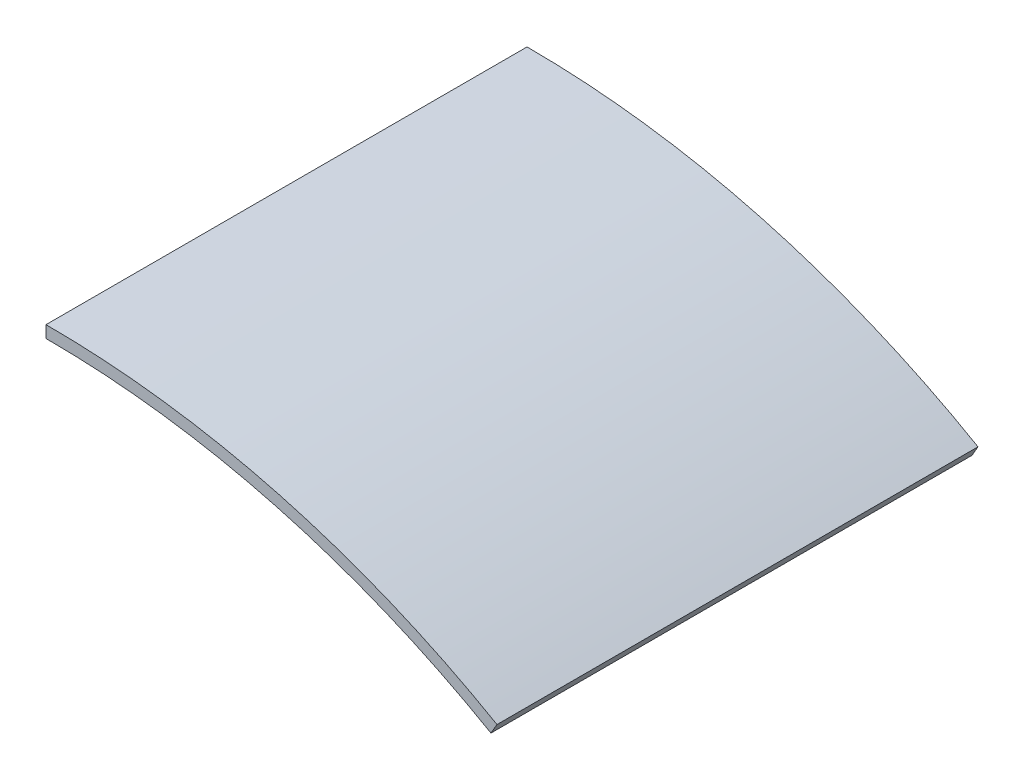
ISO-10303-21;
HEADER;
FILE_DESCRIPTION(('STEP AP214'),'2;1');
FILE_NAME('part.step','',(''),(''),'','','');
FILE_SCHEMA(('AUTOMOTIVE_DESIGN { 1 0 10303 214 1 1 1 1 }'));
ENDSEC;
DATA;
#1=APPLICATION_CONTEXT('core data for automotive mechanical design processes');
#2=APPLICATION_PROTOCOL_DEFINITION('international standard','automotive_design',2000,#1);
#3=PRODUCT_CONTEXT('',#1,'mechanical');
#4=PRODUCT('Part','Part','',(#3));
#5=PRODUCT_RELATED_PRODUCT_CATEGORY('part','',(#4));
#6=PRODUCT_DEFINITION_FORMATION('','',#4);
#7=PRODUCT_DEFINITION_CONTEXT('part definition',#1,'design');
#8=PRODUCT_DEFINITION('design','',#6,#7);
#9=PRODUCT_DEFINITION_SHAPE('','',#8);
#10=(LENGTH_UNIT() NAMED_UNIT(*) SI_UNIT(.MILLI.,.METRE.));
#11=(NAMED_UNIT(*) PLANE_ANGLE_UNIT() SI_UNIT($,.RADIAN.));
#12=(NAMED_UNIT(*) SI_UNIT($,.STERADIAN.) SOLID_ANGLE_UNIT());
#13=UNCERTAINTY_MEASURE_WITH_UNIT(LENGTH_MEASURE(1.E-05),#10,'distance_accuracy_value','');
#14=(GEOMETRIC_REPRESENTATION_CONTEXT(3) GLOBAL_UNCERTAINTY_ASSIGNED_CONTEXT((#13)) GLOBAL_UNIT_ASSIGNED_CONTEXT((#10,
#11,#12)) REPRESENTATION_CONTEXT('',''));
#15=CARTESIAN_POINT('',(0.,0.,0.));
#16=DIRECTION('',(0.,0.,1.));
#17=DIRECTION('',(1.,0.,0.));
#18=AXIS2_PLACEMENT_3D('',#15,#16,#17);
#19=CARTESIAN_POINT('',(0.,0.,20.));
#20=DIRECTION('',(0.,0.,-1.));
#21=DIRECTION('',(-1.,0.,0.));
#22=AXIS2_PLACEMENT_3D('',#19,#20,#21);
#23=CYLINDRICAL_SURFACE('',#22,37.5);
#24=CARTESIAN_POINT('',(0.,0.,0.));
#25=DIRECTION('',(0.,0.,1.));
#26=DIRECTION('',(1.,0.,0.));
#27=AXIS2_PLACEMENT_3D('',#24,#25,#26);
#28=CIRCLE('',#27,37.5);
#29=CARTESIAN_POINT('',(18.75,32.4759526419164,0.));
#30=VERTEX_POINT('',#29);
#31=CARTESIAN_POINT('',(0.,37.5,0.));
#32=VERTEX_POINT('',#31);
#33=EDGE_CURVE('E96',#30,#32,#28,.T.);
#34=ORIENTED_EDGE('',*,*,#33,.T.);
#35=DIRECTION('',(0.,0.,-1.));
#36=VECTOR('',#35,1.);
#37=CARTESIAN_POINT('',(0.,37.5,20.));
#38=LINE('',#37,#36);
#39=CARTESIAN_POINT('',(0.,37.5,20.));
#40=VERTEX_POINT('',#39);
#41=EDGE_CURVE('E11',#40,#32,#38,.T.);
#42=ORIENTED_EDGE('',*,*,#41,.F.);
#43=CARTESIAN_POINT('',(0.,0.,20.));
#44=DIRECTION('',(0.,0.,1.));
#45=DIRECTION('',(1.,0.,0.));
#46=AXIS2_PLACEMENT_3D('',#43,#44,#45);
#47=CIRCLE('',#46,37.5);
#48=CARTESIAN_POINT('',(18.75,32.4759526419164,20.));
#49=VERTEX_POINT('',#48);
#50=EDGE_CURVE('E73',#49,#40,#47,.T.);
#51=ORIENTED_EDGE('',*,*,#50,.F.);
#52=DIRECTION('',(0.,0.,-1.));
#53=VECTOR('',#52,1.);
#54=CARTESIAN_POINT('',(18.75,32.4759526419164,20.));
#55=LINE('',#54,#53);
#56=EDGE_CURVE('E49',#49,#30,#55,.T.);
#57=ORIENTED_EDGE('',*,*,#56,.T.);
#58=EDGE_LOOP('',(#34,#42,#51,#57));
#59=FACE_BOUND('',#58,.T.);
#60=ADVANCED_FACE('F33',(#59),#23,.T.);
#61=CARTESIAN_POINT('',(0.,37.,20.));
#62=DIRECTION('',(-1.,0.,0.));
#63=DIRECTION('',(0.,-1.,0.));
#64=AXIS2_PLACEMENT_3D('',#61,#62,#63);
#65=PLANE('',#64);
#66=DIRECTION('',(0.,1.,0.));
#67=VECTOR('',#66,1.);
#68=CARTESIAN_POINT('',(0.,37.,0.));
#69=LINE('',#68,#67);
#70=CARTESIAN_POINT('',(0.,37.,0.));
#71=VERTEX_POINT('',#70);
#72=EDGE_CURVE('E82',#71,#32,#69,.T.);
#73=ORIENTED_EDGE('',*,*,#72,.F.);
#74=DIRECTION('',(0.,0.,-1.));
#75=VECTOR('',#74,1.);
#76=CARTESIAN_POINT('',(0.,37.,20.));
#77=LINE('',#76,#75);
#78=CARTESIAN_POINT('',(0.,37.,20.));
#79=VERTEX_POINT('',#78);
#80=EDGE_CURVE('E41',#79,#71,#77,.T.);
#81=ORIENTED_EDGE('',*,*,#80,.F.);
#82=DIRECTION('',(0.,1.,0.));
#83=VECTOR('',#82,1.);
#84=CARTESIAN_POINT('',(0.,37.,20.));
#85=LINE('',#84,#83);
#86=EDGE_CURVE('E80',#79,#40,#85,.T.);
#87=ORIENTED_EDGE('',*,*,#86,.T.);
#88=ORIENTED_EDGE('',*,*,#41,.T.);
#89=EDGE_LOOP('',(#73,#81,#87,#88));
#90=FACE_BOUND('',#89,.T.);
#91=ADVANCED_FACE('F79',(#90),#65,.T.);
#92=CARTESIAN_POINT('',(0.,0.,20.));
#93=DIRECTION('',(0.,0.,-1.));
#94=DIRECTION('',(-1.,0.,0.));
#95=AXIS2_PLACEMENT_3D('',#92,#93,#94);
#96=CYLINDRICAL_SURFACE('',#95,37.);
#97=CARTESIAN_POINT('',(0.,0.,0.));
#98=DIRECTION('',(0.,0.,1.));
#99=DIRECTION('',(1.,0.,0.));
#100=AXIS2_PLACEMENT_3D('',#97,#98,#99);
#101=CIRCLE('',#100,37.);
#102=CARTESIAN_POINT('',(18.5,32.0429399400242,0.));
#103=VERTEX_POINT('',#102);
#104=EDGE_CURVE('E99',#103,#71,#101,.T.);
#105=ORIENTED_EDGE('',*,*,#104,.F.);
#106=DIRECTION('',(0.,0.,-1.));
#107=VECTOR('',#106,1.);
#108=CARTESIAN_POINT('',(18.5,32.0429399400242,20.));
#109=LINE('',#108,#107);
#110=CARTESIAN_POINT('',(18.5,32.0429399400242,20.));
#111=VERTEX_POINT('',#110);
#112=EDGE_CURVE('E62',#111,#103,#109,.T.);
#113=ORIENTED_EDGE('',*,*,#112,.F.);
#114=CARTESIAN_POINT('',(0.,0.,20.));
#115=DIRECTION('',(0.,0.,1.));
#116=DIRECTION('',(1.,0.,0.));
#117=AXIS2_PLACEMENT_3D('',#114,#115,#116);
#118=CIRCLE('',#117,37.);
#119=EDGE_CURVE('E88',#111,#79,#118,.T.);
#120=ORIENTED_EDGE('',*,*,#119,.T.);
#121=ORIENTED_EDGE('',*,*,#80,.T.);
#122=EDGE_LOOP('',(#105,#113,#120,#121));
#123=FACE_BOUND('',#122,.T.);
#124=ADVANCED_FACE('F90',(#123),#96,.F.);
#125=CARTESIAN_POINT('',(18.75,32.4759526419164,20.));
#126=DIRECTION('',(0.866025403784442,-0.499999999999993,0.));
#127=DIRECTION('',(0.499999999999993,0.866025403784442,0.));
#128=AXIS2_PLACEMENT_3D('',#125,#126,#127);
#129=PLANE('',#128);
#130=DIRECTION('',(-0.499999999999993,-0.866025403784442,0.));
#131=VECTOR('',#130,1.);
#132=CARTESIAN_POINT('',(18.75,32.4759526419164,0.));
#133=LINE('',#132,#131);
#134=EDGE_CURVE('E101',#30,#103,#133,.T.);
#135=ORIENTED_EDGE('',*,*,#134,.F.);
#136=ORIENTED_EDGE('',*,*,#56,.F.);
#137=DIRECTION('',(-0.499999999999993,-0.866025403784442,0.));
#138=VECTOR('',#137,1.);
#139=CARTESIAN_POINT('',(18.75,32.4759526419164,20.));
#140=LINE('',#139,#138);
#141=EDGE_CURVE('E91',#49,#111,#140,.T.);
#142=ORIENTED_EDGE('',*,*,#141,.T.);
#143=ORIENTED_EDGE('',*,*,#112,.T.);
#144=EDGE_LOOP('',(#135,#136,#142,#143));
#145=FACE_BOUND('',#144,.T.);
#146=ADVANCED_FACE('F107',(#145),#129,.T.);
#147=CARTESIAN_POINT('',(0.,0.,20.));
#148=DIRECTION('',(0.,0.,1.));
#149=DIRECTION('',(1.,0.,0.));
#150=AXIS2_PLACEMENT_3D('',#147,#148,#149);
#151=PLANE('',#150);
#152=ORIENTED_EDGE('',*,*,#50,.T.);
#153=ORIENTED_EDGE('',*,*,#86,.F.);
#154=ORIENTED_EDGE('',*,*,#119,.F.);
#155=ORIENTED_EDGE('',*,*,#141,.F.);
#156=EDGE_LOOP('',(#152,#153,#154,#155));
#157=FACE_BOUND('',#156,.T.);
#158=ADVANCED_FACE('F87',(#157),#151,.T.);
#159=CARTESIAN_POINT('',(0.,0.,0.));
#160=DIRECTION('',(0.,0.,1.));
#161=DIRECTION('',(1.,0.,0.));
#162=AXIS2_PLACEMENT_3D('',#159,#160,#161);
#163=PLANE('',#162);
#164=ORIENTED_EDGE('',*,*,#33,.F.);
#165=ORIENTED_EDGE('',*,*,#134,.T.);
#166=ORIENTED_EDGE('',*,*,#104,.T.);
#167=ORIENTED_EDGE('',*,*,#72,.T.);
#168=EDGE_LOOP('',(#164,#165,#166,#167));
#169=FACE_BOUND('',#168,.T.);
#170=ADVANCED_FACE('F106',(#169),#163,.F.);
#171=CLOSED_SHELL('',(#60,#91,#124,#146,#158,#170));
#172=MANIFOLD_SOLID_BREP('B2',#171);
#173=ADVANCED_BREP_SHAPE_REPRESENTATION('',(#18,#172),#14);
#174=SHAPE_DEFINITION_REPRESENTATION(#9,#173);
ENDSEC;
END-ISO-10303-21;
